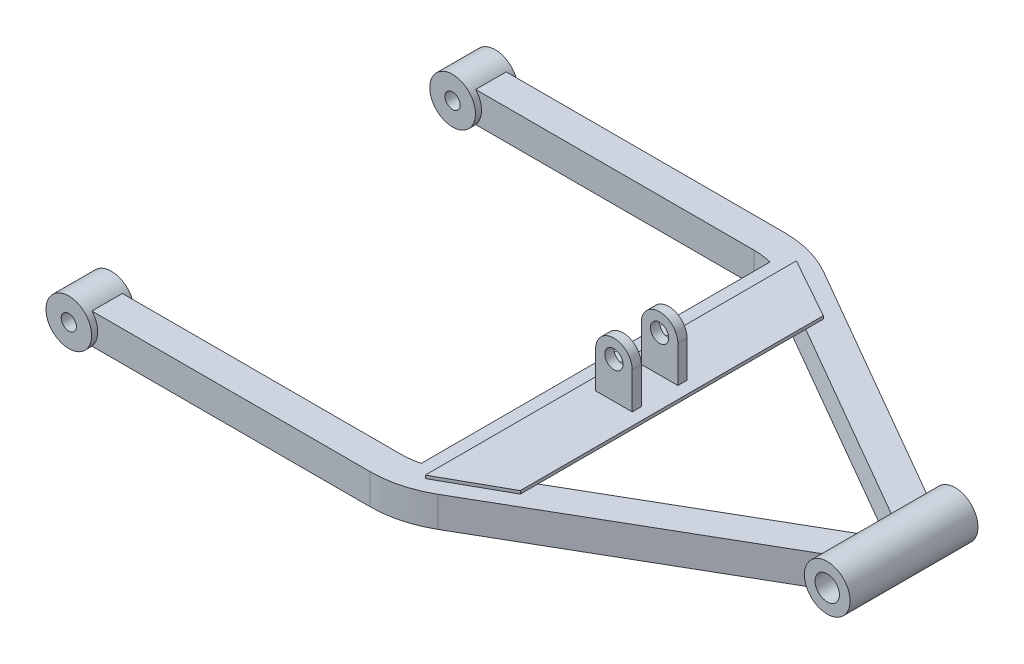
from build123d import *

# Parameters (mm, degrees)
SKETCH2_R                       = 7.5
SKETCH2_R_2                     = 2.5
BOSS_EXTRUDE1_DEPTH             = 7
SKETCH4_R                       = 7.5
SKETCH4_R_2                     = 4
BOSS_EXTRUDE2_DEPTH             = 21
SKETCH3_W                       = 10
SKETCH3_H                       = 10
CUT_EXTRUDE1_DEPTH              = 137
CUT_EXTRUDE1_DEPTH_BACK         = 20
SKETCH2_2_R                     = 2.5
SKETCH4_2_R                     = 4
CUT_EXTRUDE2_DEPTH              = 30
BOSS_EXTRUDE3_REACH             = 221.118
SKETCH5_W                       = 10
SKETCH5_H                       = 10
BOSS_EXTRUDE3_DIRECTION_2_REACH = 221.118
BOSS_EXTRUDE4_DEPTH             = 1
BOSS_EXTRUDE5_START             = 6
SKETCH7_R                       = 3
BOSS_EXTRUDE5_DEPTH             = 3


with BuildPart() as part:
    # Sketch2 → Boss-Extrude1 (new, symmetric)
    with BuildSketch(Plane.XY.offset(-63)):
        Circle(SKETCH2_R)
        Circle(SKETCH2_R_2, mode=Mode.SUBTRACT)
    boss_extrude1 = extrude(amount=BOSS_EXTRUDE1_DEPTH, both=True)



with BuildPart() as body_2:
    # Sketch4 → Boss-Extrude2 (new, symmetric)
    with BuildSketch(Plane.XY):
        with Locations(Location((200, 0, 0), (0, 0, 180))):
            Circle(SKETCH4_R)
        with Locations(Location((200, 0, 0), (0, 0, 180))):
            Circle(SKETCH4_R_2, mode=Mode.SUBTRACT)
    extrude(amount=BOSS_EXTRUDE2_DEPTH, both=True)


with BuildPart() as part_1:
    add(part.part)

    add(body_2.part)  # Sweep1 merges body 2
    # Sweep1: sweep along a path in Sketch1
    with BuildLine(Plane(origin=(0, 0, 0), x_dir=(1, 0, 0), z_dir=(0, 1, 0))) as sweep1_path:
        Line((0, 63), (96.961524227, 63))
        ThreePointArc((96.961524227, 63), (104.72609558, 61.977774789), (111.961524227, 58.980762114))
        Line((111.961524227, 58.980762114), (200, 8.151724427))
    # Sketch3 → Sweep1 (sweep)
    with BuildSketch(Plane(origin=(0, 0, -63), x_dir=(0, 0, -1), z_dir=(1, 0, 0))):
        Rectangle(SKETCH3_W, SKETCH3_H)
    sweep1 = sweep(path=sweep1_path.line)

    # Mirror1: Boss-Extrude1, Sweep1 across plane
    add(boss_extrude1.mirror(Plane.XY))
    add(sweep1.mirror(Plane.XY))

    # Sketch2_2 → Cut-Extrude1 (cut, two sides: drawn at the far end of the back side and taken through both)
    with BuildSketch(Plane.XY.offset(-63).offset(-CUT_EXTRUDE1_DEPTH_BACK)):
        Circle(SKETCH2_2_R)
    extrude(amount=CUT_EXTRUDE1_DEPTH + CUT_EXTRUDE1_DEPTH_BACK, mode=Mode.SUBTRACT)

    # Sketch4_2 → Cut-Extrude2 (cut, symmetric)
    with BuildSketch(Plane.XY):
        with Locations(Location((200, 0, 0), (0, 0, 180))):
            Circle(SKETCH4_2_R)
    extrude(amount=CUT_EXTRUDE2_DEPTH, both=True, mode=Mode.SUBTRACT)

    # Sketch5 → Boss-Extrude3 (add, up to next)
    with BuildSketch(Plane.XY, mode=Mode.PRIVATE) as boss_extrude3_sk1:
        with Locations((107.961524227, 0)):
            Rectangle(SKETCH5_W, SKETCH5_H)
    boss_extrude3_tool1 = extrude(boss_extrude3_sk1.sketch, amount=BOSS_EXTRUDE3_REACH, mode=Mode.PRIVATE) - part_1.part
    add(boss_extrude3_tool1.solids().sort_by_distance((107.961524, 0, 0))[0])

    # Sketch5 → Boss-Extrude3 direction 2 (add, up to next)
    with BuildSketch(Plane.XY, mode=Mode.PRIVATE) as boss_extrude3_direction_2_sk1:
        with Locations((107.961524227, 0)):
            Rectangle(SKETCH5_W, SKETCH5_H)
    boss_extrude3_direction_2_tool1 = extrude(boss_extrude3_direction_2_sk1.sketch, amount=-BOSS_EXTRUDE3_DIRECTION_2_REACH, mode=Mode.PRIVATE) - part_1.part
    add(boss_extrude3_direction_2_tool1.solids().sort_by_distance((107.961524, 0, 0))[0])

    # Sketch6 → Boss-Extrude4 (add)
    with BuildSketch(Plane(origin=(0, 5, 0), x_dir=(1, 0, 0), z_dir=(0, 1, 0))):
        Polygon((107.961524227, 60.910571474), (107.961524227, -60.910571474), (127.961524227, -49.743157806), (127.961524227, 49.743157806), align=None)
    extrude(amount=BOSS_EXTRUDE4_DEPTH)

    # Sketch7 → Boss-Extrude5 (add)
    with BuildSketch(Plane.XY.offset(BOSS_EXTRUDE5_START)):
        with BuildLine():
            Line((111.961524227, 6), (111.961524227, 18))
            ThreePointArc((111.961524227, 18), (117.961524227, 24), (123.961524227, 18))
            Line((123.961524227, 18), (123.961524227, 6))
            Line((123.961524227, 6), (111.961524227, 6))
        make_face()
        with Locations((117.961524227, 18)):
            Circle(SKETCH7_R, mode=Mode.SUBTRACT)
    boss_extrude5 = extrude(amount=BOSS_EXTRUDE5_DEPTH)

    # Mirror2: Boss-Extrude5 across plane
    add(boss_extrude5.mirror(Plane.XY))


solid = part_1.part
